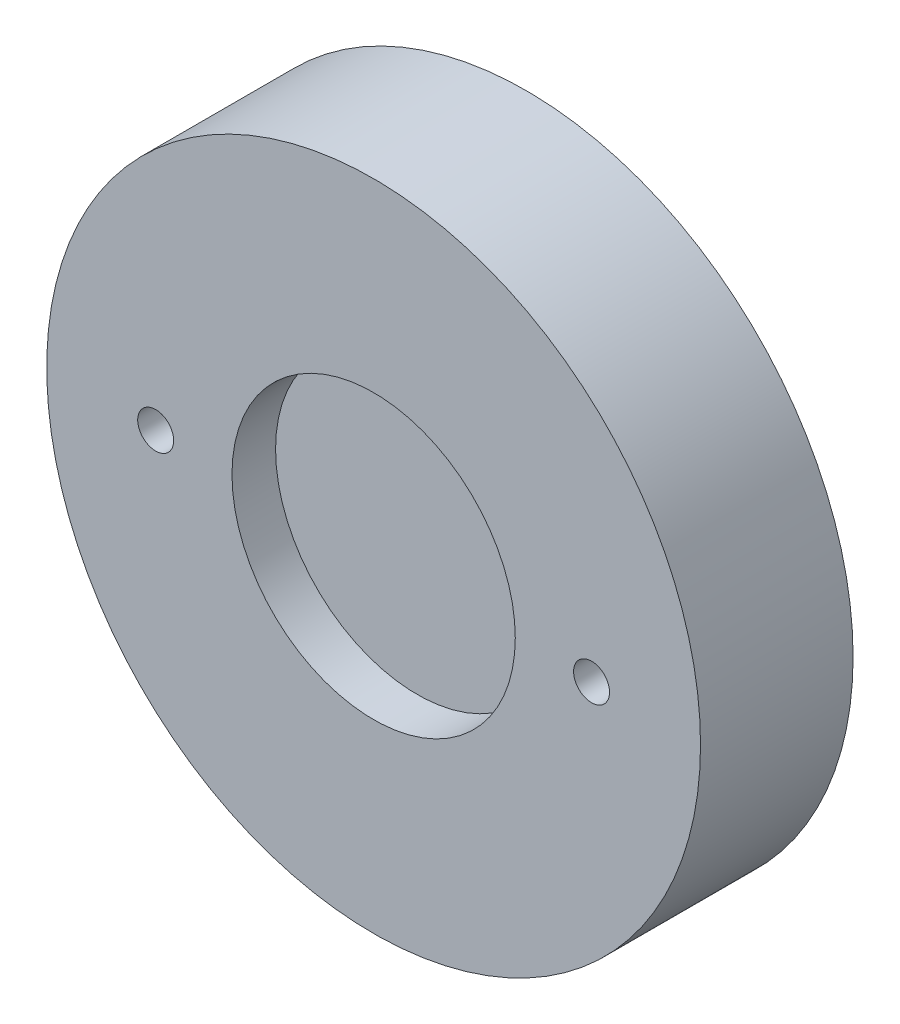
from build123d import *

# Parameters (mm, degrees)
ESQUISSE1_R                       = 60
BOSS_EXTRU_1_DEPTH                = 28
ESQUISSE2_R                       = 26
ENL_V_MAT_EXTRU_1_DEPTH           = 8
D_GAGEMENT_M62_D                  = 6.6
DIAM_TRE_DU_PER_AGE_4_0_4_2_D     = 4
DIAM_TRE_DU_PER_AGE_4_0_4_2_DEPTH = 10
DIAM_TRE_DU_PER_AGE_4_0_4_2_TIP   = 1.201721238
CHANFREIN6_SIZE                   = 0.5


with BuildPart() as part:
    # Esquisse1 → Boss.-Extru.1 (new body)
    with BuildSketch(Plane.XY):
        Circle(ESQUISSE1_R)
    extrude(amount=BOSS_EXTRU_1_DEPTH)

    # Esquisse2 → Enl_v. mat.-Extru.1 (cut)
    with BuildSketch(Plane.XY.offset(28)):
        Circle(ESQUISSE2_R)
    extrude(amount=-ENL_V_MAT_EXTRU_1_DEPTH, mode=Mode.SUBTRACT)

    # D_gagement M62 (through all)
    with Locations(Plane.XY.offset(28)):
        with Locations((-40, 0), (40, 0)):
            Hole(D_GAGEMENT_M62_D / 2)

    # Diam_tre du per_age _4.0 _4_2
    with Locations(Plane.XY.offset(20)):
        with Locations((19.5, 0)):
            Hole(DIAM_TRE_DU_PER_AGE_4_0_4_2_D / 2, depth=DIAM_TRE_DU_PER_AGE_4_0_4_2_DEPTH)
            with Locations((0, 0, -(DIAM_TRE_DU_PER_AGE_4_0_4_2_DEPTH + DIAM_TRE_DU_PER_AGE_4_0_4_2_TIP / 2))):  # 118° drill point
                Cone(0, DIAM_TRE_DU_PER_AGE_4_0_4_2_D / 2, DIAM_TRE_DU_PER_AGE_4_0_4_2_TIP, mode=Mode.SUBTRACT)

    # Chanfrein6
    chanfrein6_edges = [part.edges().sort_by_distance(p)[0] for p in [
        (21.5, 0, 20),
    ]]
    chamfer(chanfrein6_edges, length=CHANFREIN6_SIZE)


solid = part.part
